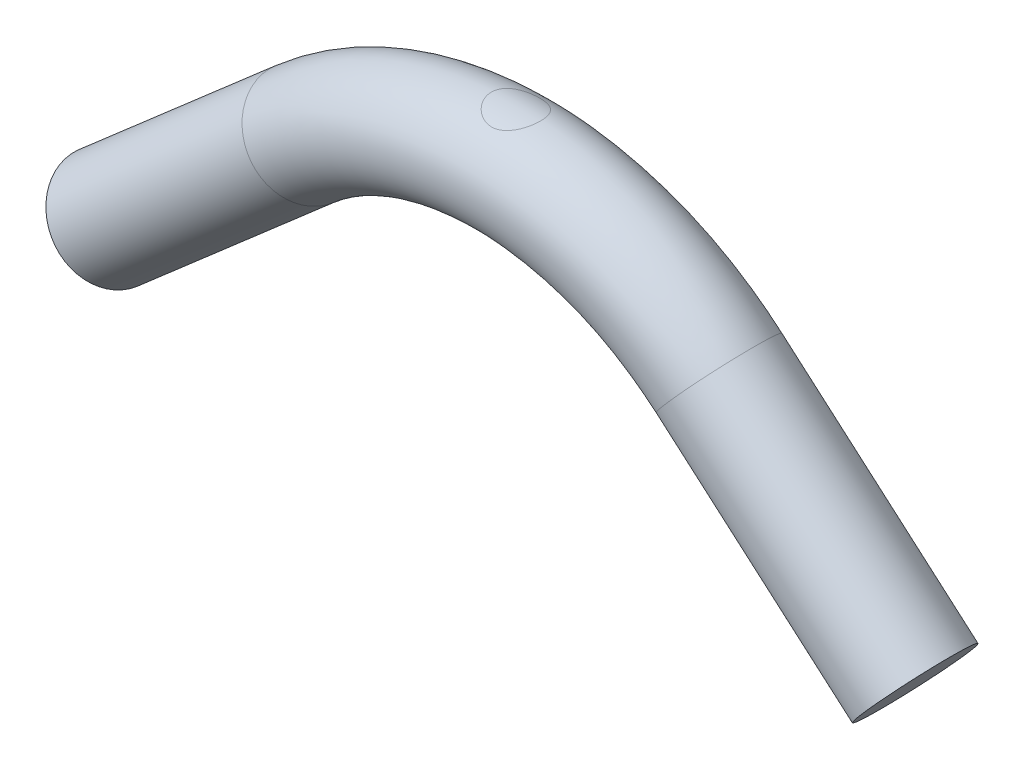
ISO-10303-21;
HEADER;
FILE_DESCRIPTION(('STEP AP214'),'2;1');
FILE_NAME('part.step','',(''),(''),'','','');
FILE_SCHEMA(('AUTOMOTIVE_DESIGN { 1 0 10303 214 1 1 1 1 }'));
ENDSEC;
DATA;
#1=APPLICATION_CONTEXT('core data for automotive mechanical design processes');
#2=APPLICATION_PROTOCOL_DEFINITION('international standard','automotive_design',2000,#1);
#3=PRODUCT_CONTEXT('',#1,'mechanical');
#4=PRODUCT('Part','Part','',(#3));
#5=PRODUCT_RELATED_PRODUCT_CATEGORY('part','',(#4));
#6=PRODUCT_DEFINITION_FORMATION('','',#4);
#7=PRODUCT_DEFINITION_CONTEXT('part definition',#1,'design');
#8=PRODUCT_DEFINITION('design','',#6,#7);
#9=PRODUCT_DEFINITION_SHAPE('','',#8);
#10=(LENGTH_UNIT() NAMED_UNIT(*) SI_UNIT(.MILLI.,.METRE.));
#11=(NAMED_UNIT(*) PLANE_ANGLE_UNIT() SI_UNIT($,.RADIAN.));
#12=(NAMED_UNIT(*) SI_UNIT($,.STERADIAN.) SOLID_ANGLE_UNIT());
#13=UNCERTAINTY_MEASURE_WITH_UNIT(LENGTH_MEASURE(1.E-05),#10,'distance_accuracy_value','');
#14=(GEOMETRIC_REPRESENTATION_CONTEXT(3) GLOBAL_UNCERTAINTY_ASSIGNED_CONTEXT((#13)) GLOBAL_UNIT_ASSIGNED_CONTEXT((#10,
#11,#12)) REPRESENTATION_CONTEXT('',''));
#15=CARTESIAN_POINT('',(0.,0.,0.));
#16=DIRECTION('',(0.,0.,1.));
#17=DIRECTION('',(1.,0.,0.));
#18=AXIS2_PLACEMENT_3D('',#15,#16,#17);
#19=CARTESIAN_POINT('',(115.,-19.2676138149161,0.));
#20=DIRECTION('',(0.,0.,-1.));
#21=DIRECTION('',(-1.,0.,0.));
#22=AXIS2_PLACEMENT_3D('',#19,#20,#21);
#23=TOROIDAL_SURFACE('',#22,90.,15.);
#24=CARTESIAN_POINT('',(110.588080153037,85.0106860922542,-4.2962066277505));
#25=CARTESIAN_POINT('',(110.710333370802,84.9688042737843,-4.4534690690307));
#26=CARTESIAN_POINT('',(110.839197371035,84.9257780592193,-4.60537547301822));
#27=CARTESIAN_POINT('',(111.1092662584,84.8385685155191,-4.89755901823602));
#28=CARTESIAN_POINT('',(111.250478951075,84.7943844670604,-5.03782869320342));
#29=CARTESIAN_POINT('',(111.544722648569,84.7059378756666,-5.30620513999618));
#30=CARTESIAN_POINT('',(111.697783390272,84.6616754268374,-5.43427938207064));
#31=CARTESIAN_POINT('',(112.014505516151,84.5744150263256,-5.67705037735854));
#32=CARTESIAN_POINT('',(112.1781667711,84.5314170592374,-5.7917472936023));
#33=CARTESIAN_POINT('',(112.515366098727,84.4478828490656,-6.00711752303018));
#34=CARTESIAN_POINT('',(112.688915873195,84.4073496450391,-6.10777371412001));
#35=CARTESIAN_POINT('',(113.044595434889,84.3300760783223,-6.29406440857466));
#36=CARTESIAN_POINT('',(113.226720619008,84.2933337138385,-6.37970685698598));
#37=CARTESIAN_POINT('',(113.598324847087,84.2248607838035,-6.53519724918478));
#38=CARTESIAN_POINT('',(113.787797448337,84.1931259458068,-6.60505867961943));
#39=CARTESIAN_POINT('',(114.172914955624,84.1357511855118,-6.72834766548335));
#40=CARTESIAN_POINT('',(114.36855940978,84.1101108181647,-6.78177642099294));
#41=CARTESIAN_POINT('',(114.755652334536,84.0668680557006,-6.8695575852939));
#42=CARTESIAN_POINT('',(114.946897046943,84.0489574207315,-6.90465638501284));
#43=CARTESIAN_POINT('',(115.332170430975,84.020196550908,-6.95885151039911));
#44=CARTESIAN_POINT('',(115.526199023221,84.0093461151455,-6.97794829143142));
#45=CARTESIAN_POINT('',(115.915391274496,83.9950818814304,-6.99987763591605));
#46=CARTESIAN_POINT('',(116.110554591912,83.9916659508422,-7.00271486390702));
#47=CARTESIAN_POINT('',(116.500417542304,83.9923464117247,-6.99207973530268));
#48=CARTESIAN_POINT('',(116.695117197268,83.9964424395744,-6.97860816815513));
#49=CARTESIAN_POINT('',(117.067728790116,84.0113360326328,-6.93714730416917));
#50=CARTESIAN_POINT('',(117.245794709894,84.0216021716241,-6.91033566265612));
#51=CARTESIAN_POINT('',(117.598975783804,84.0479765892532,-6.84317181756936));
#52=CARTESIAN_POINT('',(117.774089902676,84.0640868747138,-6.80281496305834));
#53=CARTESIAN_POINT('',(118.120129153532,84.1015870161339,-6.70895336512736));
#54=CARTESIAN_POINT('',(118.291055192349,84.1229757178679,-6.65545149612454));
#55=CARTESIAN_POINT('',(118.627805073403,84.1703534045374,-6.53573510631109));
#56=CARTESIAN_POINT('',(118.793626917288,84.1963441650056,-6.46951567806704));
#57=CARTESIAN_POINT('',(119.123873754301,84.2529417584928,-6.3228119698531));
#58=CARTESIAN_POINT('',(119.28812184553,84.2836597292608,-6.24197261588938));
#59=CARTESIAN_POINT('',(119.609366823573,84.3482341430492,-6.06795742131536));
#60=CARTESIAN_POINT('',(119.766361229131,84.3820916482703,-5.97477740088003));
#61=CARTESIAN_POINT('',(120.072280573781,84.4520067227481,-5.7766867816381));
#62=CARTESIAN_POINT('',(120.221204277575,84.4880646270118,-5.67177439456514));
#63=CARTESIAN_POINT('',(120.510238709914,84.5614402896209,-5.4508349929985));
#64=CARTESIAN_POINT('',(120.65034900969,84.5987581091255,-5.33480743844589));
#65=CARTESIAN_POINT('',(120.9322498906,84.6768284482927,-5.08223563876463));
#66=CARTESIAN_POINT('',(121.073224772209,84.7176102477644,-4.94478843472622));
#67=CARTESIAN_POINT('',(121.343156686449,84.798425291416,-4.65844140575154));
#68=CARTESIAN_POINT('',(121.472117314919,84.8384587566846,-4.50954503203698));
#69=CARTESIAN_POINT('',(121.71730888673,84.9167306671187,-4.20103378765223));
#70=CARTESIAN_POINT('',(121.833533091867,84.9549681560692,-4.04141331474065));
#71=CARTESIAN_POINT('',(122.052303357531,85.0285885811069,-3.71252862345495));
#72=CARTESIAN_POINT('',(122.154855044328,85.0639726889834,-3.54326841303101));
#73=CARTESIAN_POINT('',(122.346717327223,85.1313755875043,-3.19392038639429));
#74=CARTESIAN_POINT('',(122.435847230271,85.1633470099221,-3.01372402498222));
#75=CARTESIAN_POINT('',(122.598482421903,85.2225141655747,-2.64573895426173));
#76=CARTESIAN_POINT('',(122.671994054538,85.2497118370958,-2.45795336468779));
#77=CARTESIAN_POINT('',(122.802698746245,85.2985764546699,-2.07611951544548));
#78=CARTESIAN_POINT('',(122.859894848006,85.320244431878,-1.88207243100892));
#79=CARTESIAN_POINT('',(122.957367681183,85.3574319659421,-1.48919977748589));
#80=CARTESIAN_POINT('',(122.997645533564,85.3729519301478,-1.29037452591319));
#81=CARTESIAN_POINT('',(123.058913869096,85.3966527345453,-0.901706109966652));
#82=CARTESIAN_POINT('',(123.080923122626,85.4052205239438,-0.712046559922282));
#83=CARTESIAN_POINT('',(123.109372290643,85.4163072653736,-0.331389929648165));
#84=CARTESIAN_POINT('',(123.115812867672,85.4188264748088,-0.140392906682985));
#85=CARTESIAN_POINT('',(123.113056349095,85.4177499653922,0.241433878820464));
#86=CARTESIAN_POINT('',(123.10386215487,85.4141553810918,0.432263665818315));
#87=CARTESIAN_POINT('',(123.069940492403,85.4009480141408,0.81232491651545));
#88=CARTESIAN_POINT('',(123.045213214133,85.391335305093,1.00155639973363));
#89=CARTESIAN_POINT('',(122.981706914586,85.3668148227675,1.36992080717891));
#90=CARTESIAN_POINT('',(122.943492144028,85.3521200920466,1.54916566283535));
#91=CARTESIAN_POINT('',(122.853261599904,85.3177364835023,1.90371771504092));
#92=CARTESIAN_POINT('',(122.801241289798,85.2980459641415,2.07902359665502));
#93=CARTESIAN_POINT('',(122.683878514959,85.2541417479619,2.42447362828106));
#94=CARTESIAN_POINT('',(122.618539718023,85.2299292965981,2.59461918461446));
#95=CARTESIAN_POINT('',(122.475036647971,85.1775264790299,2.92884814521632));
#96=CARTESIAN_POINT('',(122.396867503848,85.1493346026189,3.09292921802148));
#97=CARTESIAN_POINT('',(122.225485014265,85.0886207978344,3.41941645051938));
#98=CARTESIAN_POINT('',(122.131856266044,85.0559856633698,3.58158346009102));
#99=CARTESIAN_POINT('',(121.932185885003,84.9879273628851,3.89754163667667));
#100=CARTESIAN_POINT('',(121.826139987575,84.9525032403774,4.05132989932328));
#101=CARTESIAN_POINT('',(121.602331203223,84.8797145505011,4.34968686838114));
#102=CARTESIAN_POINT('',(121.484566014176,84.8423496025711,4.49425375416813));
#103=CARTESIAN_POINT('',(121.238034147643,84.7665831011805,4.77339229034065));
#104=CARTESIAN_POINT('',(121.109267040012,84.7281815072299,4.90796354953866));
#105=CARTESIAN_POINT('',(120.83296549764,84.6488510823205,5.17458545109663));
#106=CARTESIAN_POINT('',(120.68475926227,84.6079159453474,5.30593902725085));
#107=CARTESIAN_POINT('',(120.377627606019,84.5271266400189,5.55570944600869));
#108=CARTESIAN_POINT('',(120.218705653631,84.4872721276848,5.67413044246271));
#109=CARTESIAN_POINT('',(119.89091851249,84.4098115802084,5.89736247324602));
#110=CARTESIAN_POINT('',(119.722048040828,84.3722067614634,6.00216618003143));
#111=CARTESIAN_POINT('',(119.375507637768,84.3004965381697,6.19726639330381));
#112=CARTESIAN_POINT('',(119.197841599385,84.2663896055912,6.28756924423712));
#113=CARTESIAN_POINT('',(118.834269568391,84.2027551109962,6.45317700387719));
#114=CARTESIAN_POINT('',(118.648343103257,84.1732398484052,6.5284417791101));
#115=CARTESIAN_POINT('',(118.270045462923,84.1200229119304,6.6629125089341));
#116=CARTESIAN_POINT('',(118.077677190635,84.0963186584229,6.72212559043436));
#117=CARTESIAN_POINT('',(117.687969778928,84.0556852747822,6.82386208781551));
#118=CARTESIAN_POINT('',(117.490633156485,84.0387527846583,6.86639378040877));
#119=CARTESIAN_POINT('',(117.092538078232,84.01239764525,6.93429383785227));
#120=CARTESIAN_POINT('',(116.891779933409,84.0029743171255,6.95966375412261));
#121=CARTESIAN_POINT('',(116.504768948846,83.9925301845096,6.99159556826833));
#122=CARTESIAN_POINT('',(116.318642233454,83.990896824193,6.99950115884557));
#123=CARTESIAN_POINT('',(115.94641886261,83.9944771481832,7.00045299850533));
#124=CARTESIAN_POINT('',(115.760322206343,83.9996905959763,6.99349976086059));
#125=CARTESIAN_POINT('',(115.389592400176,84.0168226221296,6.96483359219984));
#126=CARTESIAN_POINT('',(115.204959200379,84.0287409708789,6.94312116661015));
#127=CARTESIAN_POINT('',(114.838509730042,84.0589036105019,6.88519875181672));
#128=CARTESIAN_POINT('',(114.656693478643,84.0771479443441,6.84898866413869));
#129=CARTESIAN_POINT('',(114.3028996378,84.1187028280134,6.76385396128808));
#130=CARTESIAN_POINT('',(114.130793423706,84.1418324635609,6.7153735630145));
#131=CARTESIAN_POINT('',(113.791370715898,84.1928110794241,6.60563055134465));
#132=CARTESIAN_POINT('',(113.624055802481,84.2206615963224,6.54436377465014));
#133=CARTESIAN_POINT('',(113.295192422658,84.2803103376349,6.40955658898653));
#134=CARTESIAN_POINT('',(113.133643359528,84.3121081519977,6.3360174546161));
#135=CARTESIAN_POINT('',(112.817077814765,84.3788300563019,6.17718672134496));
#136=CARTESIAN_POINT('',(112.66206372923,84.4137552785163,6.09189085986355));
#137=CARTESIAN_POINT('',(112.185889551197,84.527199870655,5.80590071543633));
#138=CARTESIAN_POINT('',(111.877636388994,84.6098627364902,5.58486502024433));
#139=CARTESIAN_POINT('',(111.300992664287,84.7771921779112,5.09626568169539));
#140=CARTESIAN_POINT('',(111.032618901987,84.8618595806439,4.82868253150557));
#141=CARTESIAN_POINT('',(110.656758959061,84.9868457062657,4.38774965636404));
#142=CARTESIAN_POINT('',(110.532732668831,85.0293850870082,4.22886253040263));
#143=CARTESIAN_POINT('',(110.298553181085,85.1116147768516,3.90051516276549));
#144=CARTESIAN_POINT('',(110.188394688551,85.1513061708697,3.73105899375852));
#145=CARTESIAN_POINT('',(109.982792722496,85.2267917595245,3.38255586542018));
#146=CARTESIAN_POINT('',(109.887353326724,85.2625848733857,3.20350626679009));
#147=CARTESIAN_POINT('',(109.712122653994,85.3292764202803,2.83712420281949));
#148=CARTESIAN_POINT('',(109.632323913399,85.3601771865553,2.64979574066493));
#149=CARTESIAN_POINT('',(109.491432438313,85.4153422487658,2.27427805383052));
#150=CARTESIAN_POINT('',(109.429820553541,85.4397880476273,2.08631035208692));
#151=CARTESIAN_POINT('',(109.322620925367,85.4826476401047,1.70526817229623));
#152=CARTESIAN_POINT('',(109.277026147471,85.5010640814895,1.51219597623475));
#153=CARTESIAN_POINT('',(109.202346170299,85.531371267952,1.12244027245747));
#154=CARTESIAN_POINT('',(109.173255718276,85.5432640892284,0.925757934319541));
#155=CARTESIAN_POINT('',(109.131906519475,85.5602014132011,0.53034304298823));
#156=CARTESIAN_POINT('',(109.119646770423,85.5652463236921,0.331610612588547));
#157=CARTESIAN_POINT('',(109.112361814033,85.5682422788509,-0.0525573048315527));
#158=CARTESIAN_POINT('',(109.116211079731,85.5666566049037,-0.237968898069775));
#159=CARTESIAN_POINT('',(109.138590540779,85.5574650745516,-0.607752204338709));
#160=CARTESIAN_POINT('',(109.157120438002,85.5498593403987,-0.792123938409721));
#161=CARTESIAN_POINT('',(109.208680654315,85.5288071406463,-1.15857657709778));
#162=CARTESIAN_POINT('',(109.241717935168,85.5153578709,-1.3406563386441));
#163=CARTESIAN_POINT('',(109.321961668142,85.4829410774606,-1.70115684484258));
#164=CARTESIAN_POINT('',(109.369167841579,85.4639736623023,-1.87957766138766));
#165=CARTESIAN_POINT('',(109.476837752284,85.4211512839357,-2.23007003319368));
#166=CARTESIAN_POINT('',(109.537184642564,85.397339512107,-2.40218284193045));
#167=CARTESIAN_POINT('',(109.670873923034,85.345256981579,-2.74067575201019));
#168=CARTESIAN_POINT('',(109.744222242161,85.3169841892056,-2.9070531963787));
#169=CARTESIAN_POINT('',(109.903134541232,85.2566806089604,-3.23268376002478));
#170=CARTESIAN_POINT('',(109.988671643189,85.2246581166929,-3.3919515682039));
#171=CARTESIAN_POINT('',(110.171469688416,85.157496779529,-3.70290615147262));
#172=CARTESIAN_POINT('',(110.268728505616,85.1223585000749,-3.85459429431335));
#173=CARTESIAN_POINT('',(110.406347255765,85.0737364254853,-4.05208266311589));
#174=CARTESIAN_POINT('',(110.441822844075,85.0612916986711,-4.10159895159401));
#175=CARTESIAN_POINT('',(110.514020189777,85.0361622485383,-4.1996455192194));
#176=CARTESIAN_POINT('',(110.550741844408,85.0234775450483,-4.248175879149));
#177=CARTESIAN_POINT('',(110.588080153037,85.0106860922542,-4.2962066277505));
#178=B_SPLINE_CURVE_WITH_KNOTS('',3,(#24,#25,#26,#27,#28,#29,#30,#31,#32,#33,#34,#35,#36,#37,
#38,#39,#40,#41,#42,#43,#44,#45,#46,#47,#48,#49,#50,#51,#52,#53,#54,#55,#56,#57,#58,#59,#60,#61,
#62,#63,#64,#65,#66,#67,#68,#69,#70,#71,#72,#73,#74,#75,#76,#77,#78,#79,#80,#81,#82,#83,#84,#85,
#86,#87,#88,#89,#90,#91,#92,#93,#94,#95,#96,#97,#98,#99,#100,#101,#102,#103,#104,#105,#106,#107,
#108,#109,#110,#111,#112,#113,#114,#115,#116,#117,#118,#119,#120,#121,#122,#123,#124,#125,#126,
#127,#128,#129,#130,#131,#132,#133,#134,#135,#136,#137,#138,#139,#140,#141,#142,#143,#144,#145,
#146,#147,#148,#149,#150,#151,#152,#153,#154,#155,#156,#157,#158,#159,#160,#161,#162,#163,#164,
#165,#166,#167,#168,#169,#170,#171,#172,#173,#174,#175,#176,#177),.UNSPECIFIED.,.T.,.F.,(4,2,2,
2,2,2,2,2,2,2,2,2,2,2,2,2,2,2,2,2,2,2,2,2,2,2,2,2,2,2,2,2,2,2,2,2,2,2,2,2,2,2,2,2,2,2,2,2,2,2,2,
2,2,2,2,2,2,2,2,2,2,2,2,2,2,2,2,2,2,2,2,2,2,2,2,2,4),(0.,0.610583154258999,1.22155508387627,
1.83411354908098,2.44666454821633,3.05995611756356,3.67292215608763,4.28536234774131,
4.89775780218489,5.4827606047,6.06774675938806,6.65256508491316,7.23735510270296,
7.77782479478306,8.31848025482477,8.85901759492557,9.39976393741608,9.9560409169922,
10.5125067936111,11.0690576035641,11.6256354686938,12.2281490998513,12.8304818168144,
13.433131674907,14.0355327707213,14.6454316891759,15.2550823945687,15.8646193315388,
16.4741158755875,17.0467669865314,17.6193937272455,18.1919142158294,18.7644277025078,
19.3153806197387,19.8665148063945,20.4174974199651,20.9686896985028,21.5382990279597,
22.1081045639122,22.678022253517,23.2479622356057,23.8539298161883,24.4597021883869,
25.0657991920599,25.6716302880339,26.2790572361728,26.8862140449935,27.49306922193,
28.0998695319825,28.6580674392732,29.216246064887,29.7744055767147,30.3325688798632,
30.8728608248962,31.4133289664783,31.9537410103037,32.4943495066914,33.6537163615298,
34.8135702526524,35.4309340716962,36.0480614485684,36.6653594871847,37.2823622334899,
37.879517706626,38.4764105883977,39.0731133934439,39.6697806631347,40.2254808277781,
40.7811697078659,41.3371255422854,41.8930704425,42.4442602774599,42.9957021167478,
43.5459462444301,44.0960907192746,44.2825890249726,44.4690719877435),.UNSPECIFIED.);
#179=CARTESIAN_POINT('',(110.588080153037,85.0106860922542,-4.2962066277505));
#180=VERTEX_POINT('',#179);
#181=EDGE_CURVE('E43',#180,#180,#178,.T.);
#182=ORIENTED_EDGE('',*,*,#181,.T.);
#183=EDGE_LOOP('',(#182));
#184=FACE_BOUND('',#183,.T.);
#185=CARTESIAN_POINT('',(55.9439156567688,48.6468831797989,0.));
#186=DIRECTION('',(0.7546055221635,0.656178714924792,0.));
#187=DIRECTION('',(0.,0.,-1.));
#188=AXIS2_PLACEMENT_3D('',#185,#186,#187);
#189=CIRCLE('',#188,15.);
#190=CARTESIAN_POINT('',(65.7865963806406,37.3278003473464,0.));
#191=VERTEX_POINT('',#190);
#192=EDGE_CURVE('E100',#191,#191,#189,.T.);
#193=ORIENTED_EDGE('',*,*,#192,.T.);
#194=EDGE_LOOP('',(#193));
#195=FACE_BOUND('',#194,.T.);
#196=CARTESIAN_POINT('',(174.056084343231,48.6468831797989,0.));
#197=DIRECTION('',(0.754605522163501,-0.656178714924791,0.));
#198=DIRECTION('',(0.,0.,-1.));
#199=AXIS2_PLACEMENT_3D('',#196,#197,#198);
#200=CIRCLE('',#199,15.);
#201=CARTESIAN_POINT('',(174.056084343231,48.6468831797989,-15.));
#202=VERTEX_POINT('',#201);
#203=EDGE_CURVE('E105',#202,#202,#200,.T.);
#204=ORIENTED_EDGE('',*,*,#203,.F.);
#205=EDGE_LOOP('',(#204));
#206=FACE_BOUND('',#205,.T.);
#207=CARTESIAN_POINT('',(109.933391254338,55.9260523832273,-3.28518633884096));
#208=CARTESIAN_POINT('',(109.850554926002,55.885405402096,-3.12933368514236));
#209=CARTESIAN_POINT('',(109.773418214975,55.8468356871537,-2.96996870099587));
#210=CARTESIAN_POINT('',(109.631107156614,55.7747094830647,-2.64490910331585));
#211=CARTESIAN_POINT('',(109.565928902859,55.7411513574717,-2.47921657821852));
#212=CARTESIAN_POINT('',(109.448105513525,55.6798497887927,-2.14230960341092));
#213=CARTESIAN_POINT('',(109.395465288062,55.6521086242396,-1.97109302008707));
#214=CARTESIAN_POINT('',(109.30331881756,55.6031764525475,-1.62431099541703));
#215=CARTESIAN_POINT('',(109.26380711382,55.5819827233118,-1.44874739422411));
#216=CARTESIAN_POINT('',(109.19823362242,55.5466375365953,-1.09376995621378));
#217=CARTESIAN_POINT('',(109.172219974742,55.5325112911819,-0.914344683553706));
#218=CARTESIAN_POINT('',(109.134183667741,55.5118103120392,-0.553578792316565));
#219=CARTESIAN_POINT('',(109.122161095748,55.5052356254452,-0.372238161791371));
#220=CARTESIAN_POINT('',(109.112266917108,55.4998269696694,-0.0090883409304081));
#221=CARTESIAN_POINT('',(109.114392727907,55.5009915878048,0.172720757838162));
#222=CARTESIAN_POINT('',(109.132761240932,55.5110249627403,0.535405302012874));
#223=CARTESIAN_POINT('',(109.149003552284,55.5198935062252,0.716280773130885));
#224=CARTESIAN_POINT('',(109.194351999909,55.5445161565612,1.06766132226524));
#225=CARTESIAN_POINT('',(109.222850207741,55.5599445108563,1.23826836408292));
#226=CARTESIAN_POINT('',(109.292221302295,55.5972131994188,1.57629228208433));
#227=CARTESIAN_POINT('',(109.333098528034,55.6190557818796,1.74370801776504));
#228=CARTESIAN_POINT('',(109.42678661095,55.6686122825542,2.07422933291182));
#229=CARTESIAN_POINT('',(109.479595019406,55.6963249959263,2.23733578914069));
#230=CARTESIAN_POINT('',(109.596671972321,55.7569884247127,2.55843976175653));
#231=CARTESIAN_POINT('',(109.660945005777,55.7899411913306,2.71643524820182));
#232=CARTESIAN_POINT('',(109.803620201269,55.8619713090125,3.03363393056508));
#233=CARTESIAN_POINT('',(109.882536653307,55.9012607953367,3.19255779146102));
#234=CARTESIAN_POINT('',(110.051700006,55.9838618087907,3.50319043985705));
#235=CARTESIAN_POINT('',(110.141950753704,56.0271747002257,3.65489675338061));
#236=CARTESIAN_POINT('',(110.428795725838,56.1617269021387,4.09820480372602));
#237=CARTESIAN_POINT('',(110.64154113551,56.2576102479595,4.37812457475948));
#238=CARTESIAN_POINT('',(111.132614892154,56.4651011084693,4.93278331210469));
#239=CARTESIAN_POINT('',(111.415692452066,56.5772406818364,5.20313606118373));
#240=CARTESIAN_POINT('',(111.871962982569,56.7405613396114,5.5711918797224));
#241=CARTESIAN_POINT('',(112.029453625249,56.794223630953,5.68770192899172));
#242=CARTESIAN_POINT('',(112.354438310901,56.8984238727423,5.90758204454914));
#243=CARTESIAN_POINT('',(112.521933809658,56.9489613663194,6.01095019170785));
#244=CARTESIAN_POINT('',(112.872765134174,57.0472016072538,6.20744543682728));
#245=CARTESIAN_POINT('',(113.056463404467,57.094718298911,6.30001960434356));
#246=CARTESIAN_POINT('',(113.432595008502,57.1829107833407,6.46909885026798));
#247=CARTESIAN_POINT('',(113.625023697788,57.2235901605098,6.54561235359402));
#248=CARTESIAN_POINT('',(114.017158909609,57.2964360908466,6.68159298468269));
#249=CARTESIAN_POINT('',(114.216857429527,57.3286117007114,6.74107825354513));
#250=CARTESIAN_POINT('',(114.622039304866,57.3830352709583,6.84220611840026));
#251=CARTESIAN_POINT('',(114.827521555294,57.4052851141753,6.88385209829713));
#252=CARTESIAN_POINT('',(115.217354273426,57.4367328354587,6.94471296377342));
#253=CARTESIAN_POINT('',(115.401279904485,57.4471770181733,6.96602063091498));
#254=CARTESIAN_POINT('',(115.770527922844,57.4590600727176,6.99398833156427));
#255=CARTESIAN_POINT('',(115.955850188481,57.460499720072,7.00064962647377));
#256=CARTESIAN_POINT('',(116.326238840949,57.4542531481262,6.99925059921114));
#257=CARTESIAN_POINT('',(116.51130527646,57.4465690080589,6.99119363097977));
#258=CARTESIAN_POINT('',(116.87963072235,57.4223125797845,6.96052483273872));
#259=CARTESIAN_POINT('',(117.062889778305,57.4057405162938,6.93791337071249));
#260=CARTESIAN_POINT('',(117.40965439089,57.3661480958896,6.88119790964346));
#261=CARTESIAN_POINT('',(117.573445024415,57.3438482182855,6.84832112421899));
#262=CARTESIAN_POINT('',(117.897363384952,57.2929767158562,6.77123078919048));
#263=CARTESIAN_POINT('',(118.057489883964,57.2644030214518,6.72701349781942));
#264=CARTESIAN_POINT('',(118.530994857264,57.1703626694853,6.5780281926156));
#265=CARTESIAN_POINT('',(118.837722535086,57.09654962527,6.45688942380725));
#266=CARTESIAN_POINT('',(119.453484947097,56.9264219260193,6.16267158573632));
#267=CARTESIAN_POINT('',(119.760383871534,56.8287055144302,5.98598162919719));
#268=CARTESIAN_POINT('',(120.342251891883,56.6241435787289,5.59026743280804));
#269=CARTESIAN_POINT('',(120.617198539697,56.5172917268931,5.37121371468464));
#270=CARTESIAN_POINT('',(121.167239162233,56.2882922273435,4.86110788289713));
#271=CARTESIAN_POINT('',(121.43702584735,56.1660858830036,4.56427808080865));
#272=CARTESIAN_POINT('',(121.801980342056,55.9919702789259,4.08586020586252));
#273=CARTESIAN_POINT('',(121.917064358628,55.9354349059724,3.92075668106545));
#274=CARTESIAN_POINT('',(122.13321618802,55.8268803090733,3.58010025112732));
#275=CARTESIAN_POINT('',(122.234282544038,55.7748615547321,3.40454626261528));
#276=CARTESIAN_POINT('',(122.421895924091,55.6765783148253,3.04301517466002));
#277=CARTESIAN_POINT('',(122.508361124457,55.6303466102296,2.85698665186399));
#278=CARTESIAN_POINT('',(122.665069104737,55.5454021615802,2.47665936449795));
#279=CARTESIAN_POINT('',(122.735320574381,55.5066853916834,2.28236509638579));
#280=CARTESIAN_POINT('',(122.858640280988,55.4380433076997,1.88705594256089));
#281=CARTESIAN_POINT('',(122.911722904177,55.4081106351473,1.68604684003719));
#282=CARTESIAN_POINT('',(122.999939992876,55.3580485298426,1.27893799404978));
#283=CARTESIAN_POINT('',(123.035077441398,55.337917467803,1.07283910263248));
#284=CARTESIAN_POINT('',(123.083559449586,55.3100574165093,0.6836250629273));
#285=CARTESIAN_POINT('',(123.099083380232,55.3010902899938,0.500866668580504));
#286=CARTESIAN_POINT('',(123.115726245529,55.2914748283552,0.134483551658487));
#287=CARTESIAN_POINT('',(123.116846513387,55.2908257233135,-0.0491410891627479));
#288=CARTESIAN_POINT('',(123.104667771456,55.2978648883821,-0.415711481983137));
#289=CARTESIAN_POINT('',(123.091371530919,55.3055515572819,-0.598657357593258));
#290=CARTESIAN_POINT('',(123.050555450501,55.329033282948,-0.962422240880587));
#291=CARTESIAN_POINT('',(123.02303577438,55.3448282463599,-1.1432412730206));
#292=CARTESIAN_POINT('',(122.956437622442,55.3827706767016,-1.48944929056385));
#293=CARTESIAN_POINT('',(122.918249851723,55.4044256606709,-1.65506455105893));
#294=CARTESIAN_POINT('',(122.830226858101,55.4538864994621,-1.98225207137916));
#295=CARTESIAN_POINT('',(122.780387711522,55.4816944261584,-2.14382294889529));
#296=CARTESIAN_POINT('',(122.614127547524,55.5734192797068,-2.62099858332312));
#297=CARTESIAN_POINT('',(122.480912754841,55.6456673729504,-2.92932741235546));
#298=CARTESIAN_POINT('',(122.16266660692,55.8123722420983,-3.54250955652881));
#299=CARTESIAN_POINT('',(121.974502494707,55.90808679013,-3.84537433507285));
#300=CARTESIAN_POINT('',(121.556607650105,56.1100774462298,-4.41704614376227));
#301=CARTESIAN_POINT('',(121.326848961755,56.2163606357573,-4.68583006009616));
#302=CARTESIAN_POINT('',(120.798507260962,56.4445796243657,-5.21713390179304));
#303=CARTESIAN_POINT('',(120.494899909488,56.5668001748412,-5.47459651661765));
#304=CARTESIAN_POINT('',(120.008454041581,56.7424748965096,-5.82045871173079));
#305=CARTESIAN_POINT('',(119.841013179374,56.7997921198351,-5.92908201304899));
#306=CARTESIAN_POINT('',(119.496356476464,56.9102842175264,-6.13219508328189));
#307=CARTESIAN_POINT('',(119.319139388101,56.9634585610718,-6.22668304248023));
#308=CARTESIAN_POINT('',(118.952475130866,57.064925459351,-6.40223813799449));
#309=CARTESIAN_POINT('',(118.762861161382,57.1131080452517,-6.48302105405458));
#310=CARTESIAN_POINT('',(118.375727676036,57.2016966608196,-6.62797561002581));
#311=CARTESIAN_POINT('',(118.178212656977,57.242107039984,-6.69215654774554));
#312=CARTESIAN_POINT('',(117.77690577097,57.3135602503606,-6.80294567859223));
#313=CARTESIAN_POINT('',(117.573121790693,57.3446143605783,-6.84957504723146));
#314=CARTESIAN_POINT('',(117.160904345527,57.3961027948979,-6.9245316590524));
#315=CARTESIAN_POINT('',(116.952471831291,57.4165392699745,-6.95286260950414));
#316=CARTESIAN_POINT('',(116.561845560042,57.4438989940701,-6.98806225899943));
#317=CARTESIAN_POINT('',(116.379967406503,57.4522895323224,-6.99733876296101));
#318=CARTESIAN_POINT('',(116.01585647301,57.4602593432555,-7.00167005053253));
#319=CARTESIAN_POINT('',(115.833623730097,57.4598394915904,-6.99672624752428));
#320=CARTESIAN_POINT('',(115.470348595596,57.4502660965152,-6.97266497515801));
#321=CARTESIAN_POINT('',(115.289306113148,57.4411132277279,-6.95354860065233));
#322=CARTESIAN_POINT('',(114.929866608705,57.4144750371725,-6.90140193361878));
#323=CARTESIAN_POINT('',(114.751469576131,57.3969897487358,-6.86837169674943));
#324=CARTESIAN_POINT('',(114.411640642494,57.3559320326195,-6.79175506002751));
#325=CARTESIAN_POINT('',(114.249926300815,57.332902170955,-6.74912422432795));
#326=CARTESIAN_POINT('',(113.93079648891,57.2809746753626,-6.65272483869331));
#327=CARTESIAN_POINT('',(113.77338247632,57.2520750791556,-6.59895256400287));
#328=CARTESIAN_POINT('',(113.308815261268,57.1577552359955,-6.4216209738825));
#329=CARTESIAN_POINT('',(113.009179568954,57.084693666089,-6.28201092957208));
#330=CARTESIAN_POINT('',(112.405896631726,56.9171793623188,-5.94780617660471));
#331=CARTESIAN_POINT('',(112.104980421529,56.821302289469,-5.74904499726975));
#332=CARTESIAN_POINT('',(111.538416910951,56.6230240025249,-5.30913801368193));
#333=CARTESIAN_POINT('',(111.272766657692,56.520623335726,-5.06799576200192));
#334=CARTESIAN_POINT('',(110.81267729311,56.3314986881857,-4.58113048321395));
#335=CARTESIAN_POINT('',(110.613472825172,56.2444556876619,-4.34000639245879));
#336=CARTESIAN_POINT('',(110.247901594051,56.0780784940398,-3.83139325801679));
#337=CARTESIAN_POINT('',(110.08153211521,55.9987436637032,-3.56390639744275));
#338=CARTESIAN_POINT('',(109.933391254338,55.9260523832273,-3.28518633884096));
#339=B_SPLINE_CURVE_WITH_KNOTS('',3,(#207,#208,#209,#210,#211,#212,#213,#214,#215,#216,#217,
#218,#219,#220,#221,#222,#223,#224,#225,#226,#227,#228,#229,#230,#231,#232,#233,#234,#235,#236,
#237,#238,#239,#240,#241,#242,#243,#244,#245,#246,#247,#248,#249,#250,#251,#252,#253,#254,#255,
#256,#257,#258,#259,#260,#261,#262,#263,#264,#265,#266,#267,#268,#269,#270,#271,#272,#273,#274,
#275,#276,#277,#278,#279,#280,#281,#282,#283,#284,#285,#286,#287,#288,#289,#290,#291,#292,#293,
#294,#295,#296,#297,#298,#299,#300,#301,#302,#303,#304,#305,#306,#307,#308,#309,#310,#311,#312,
#313,#314,#315,#316,#317,#318,#319,#320,#321,#322,#323,#324,#325,#326,#327,#328,#329,#330,#331,
#332,#333,#334,#335,#336,#337,#338),.UNSPECIFIED.,.T.,.F.,(4,2,2,2,2,2,2,2,2,2,2,2,2,2,2,2,2,2,
2,2,2,2,2,2,2,2,2,2,2,2,2,2,2,2,2,2,2,2,2,2,2,2,2,2,2,2,2,2,2,2,2,2,2,2,2,2,2,2,2,2,2,2,2,2,2,
4),(0.,0.543124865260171,1.08607199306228,1.62923140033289,2.17216468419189,2.7170212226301,
3.26188116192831,3.80664164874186,4.35138705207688,4.87176476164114,5.39232508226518,
5.91277866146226,6.43343647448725,6.97806685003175,7.52288258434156,8.61208418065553,
9.82792244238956,10.4367184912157,11.045603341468,11.6781116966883,12.3102874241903,
12.9417871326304,13.5731669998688,14.1287430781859,14.6842713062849,15.2396729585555,
15.7950605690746,16.3001162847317,16.8053388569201,17.8151062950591,18.913017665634,
20.0116957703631,21.2633135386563,21.8898263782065,22.5164042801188,23.1463846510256,
23.7760265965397,24.4051395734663,25.0341479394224,25.5843230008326,26.1344471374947,
26.6844656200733,27.2344777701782,27.7479016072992,28.2614985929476,29.2878984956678,
30.3911445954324,31.4951349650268,32.7382405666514,33.3606085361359,33.9830561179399,
34.6171511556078,35.2508903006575,35.8838623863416,36.5167061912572,37.0628864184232,
37.6090123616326,38.1550961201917,38.7011776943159,39.2070780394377,39.7131477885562,
40.7248046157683,41.8400535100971,42.9552089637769,43.9265900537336,44.8978907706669),.UNSPECIFIED.);
#340=CARTESIAN_POINT('',(109.933391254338,55.9260523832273,-3.28518633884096));
#341=VERTEX_POINT('',#340);
#342=EDGE_CURVE('E10',#341,#341,#339,.T.);
#343=ORIENTED_EDGE('',*,*,#342,.T.);
#344=EDGE_LOOP('',(#343));
#345=FACE_BOUND('',#344,.T.);
#346=ADVANCED_FACE('F39',(#184,#195,#206,#345),#23,.T.);
#347=ORIENTED_EDGE('',*,*,#342,.F.);
#348=EDGE_LOOP('',(#347));
#349=FACE_BOUND('',#348,.T.);
#350=ADVANCED_FACE('F66',(#349),#23,.T.);
#351=CARTESIAN_POINT('',(55.9439156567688,48.6468831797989,0.));
#352=DIRECTION('',(-0.754605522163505,-0.656178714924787,0.));
#353=DIRECTION('',(0.656178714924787,-0.754605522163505,0.));
#354=AXIS2_PLACEMENT_3D('',#351,#352,#353);
#355=CYLINDRICAL_SURFACE('',#354,15.);
#356=CARTESIAN_POINT('',(0.,0.,0.));
#357=DIRECTION('',(0.7546055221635,0.656178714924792,0.));
#358=DIRECTION('',(0.,0.,-1.));
#359=AXIS2_PLACEMENT_3D('',#356,#357,#358);
#360=CIRCLE('',#359,15.);
#361=CARTESIAN_POINT('',(9.84268072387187,-11.3190828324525,0.));
#362=VERTEX_POINT('',#361);
#363=EDGE_CURVE('E60',#362,#362,#360,.T.);
#364=CARTESIAN_POINT('',(65.7865963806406,37.3278003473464,0.));
#365=CARTESIAN_POINT('',(65.203847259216,36.8210619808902,0.));
#366=CARTESIAN_POINT('',(64.6210981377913,36.3143236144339,0.));
#367=CARTESIAN_POINT('',(63.455599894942,35.3008468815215,0.));
#368=CARTESIAN_POINT('',(62.8728507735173,34.7941085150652,0.));
#369=CARTESIAN_POINT('',(61.7073525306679,33.7806317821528,0.));
#370=CARTESIAN_POINT('',(61.1246034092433,33.2738934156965,0.));
#371=CARTESIAN_POINT('',(59.9591051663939,32.260416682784,0.));
#372=CARTESIAN_POINT('',(59.3763560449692,31.7536783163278,0.));
#373=CARTESIAN_POINT('',(58.2108578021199,30.7402015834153,0.));
#374=CARTESIAN_POINT('',(57.6281086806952,30.2334632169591,0.));
#375=CARTESIAN_POINT('',(56.4626104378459,29.2199864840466,0.));
#376=CARTESIAN_POINT('',(55.8798613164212,28.7132481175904,0.));
#377=CARTESIAN_POINT('',(54.7143630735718,27.6997713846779,0.));
#378=CARTESIAN_POINT('',(54.1316139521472,27.1930330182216,0.));
#379=CARTESIAN_POINT('',(52.9661157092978,26.1795562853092,0.));
#380=CARTESIAN_POINT('',(52.3833665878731,25.6728179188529,0.));
#381=CARTESIAN_POINT('',(51.2178683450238,24.6593411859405,0.));
#382=CARTESIAN_POINT('',(50.6351192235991,24.1526028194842,0.));
#383=CARTESIAN_POINT('',(49.4696209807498,23.1391260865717,0.));
#384=CARTESIAN_POINT('',(48.8868718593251,22.6323877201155,0.));
#385=CARTESIAN_POINT('',(47.7213736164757,21.618910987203,0.));
#386=CARTESIAN_POINT('',(47.1386244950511,21.1121726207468,0.));
#387=CARTESIAN_POINT('',(45.9731262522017,20.0986958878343,0.));
#388=CARTESIAN_POINT('',(45.390377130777,19.5919575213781,0.));
#389=CARTESIAN_POINT('',(44.2248788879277,18.5784807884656,0.));
#390=CARTESIAN_POINT('',(43.642129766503,18.0717424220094,0.));
#391=CARTESIAN_POINT('',(42.4766315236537,17.0582656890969,0.));
#392=CARTESIAN_POINT('',(41.893882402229,16.5515273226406,0.));
#393=CARTESIAN_POINT('',(40.7283841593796,15.5380505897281,0.));
#394=CARTESIAN_POINT('',(40.145635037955,15.0313122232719,0.));
#395=CARTESIAN_POINT('',(38.9801367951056,14.0178354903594,0.));
#396=CARTESIAN_POINT('',(38.3973876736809,13.5110971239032,0.));
#397=CARTESIAN_POINT('',(37.2318894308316,12.4976203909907,0.));
#398=CARTESIAN_POINT('',(36.6491403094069,11.9908820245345,0.));
#399=CARTESIAN_POINT('',(35.4836420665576,10.977405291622,0.));
#400=CARTESIAN_POINT('',(34.9008929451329,10.4706669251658,0.));
#401=CARTESIAN_POINT('',(33.7353947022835,9.45719019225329,0.));
#402=CARTESIAN_POINT('',(33.1526455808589,8.95045182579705,0.));
#403=CARTESIAN_POINT('',(31.9871473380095,7.93697509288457,0.));
#404=CARTESIAN_POINT('',(31.4043982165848,7.43023672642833,0.));
#405=CARTESIAN_POINT('',(30.2388999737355,6.41675999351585,0.));
#406=CARTESIAN_POINT('',(29.6561508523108,5.91002162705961,0.));
#407=CARTESIAN_POINT('',(28.4906526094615,4.89654489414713,0.));
#408=CARTESIAN_POINT('',(27.9079034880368,4.38980652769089,0.));
#409=CARTESIAN_POINT('',(26.7424052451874,3.37632979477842,0.));
#410=CARTESIAN_POINT('',(26.1596561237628,2.86959142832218,0.));
#411=CARTESIAN_POINT('',(24.9941578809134,1.8561146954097,0.));
#412=CARTESIAN_POINT('',(24.4114087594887,1.34937632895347,0.));
#413=CARTESIAN_POINT('',(23.2459105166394,0.335899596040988,0.));
#414=CARTESIAN_POINT('',(22.6631613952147,-0.170838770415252,0.));
#415=CARTESIAN_POINT('',(21.4976631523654,-1.18431550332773,0.));
#416=CARTESIAN_POINT('',(20.9149140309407,-1.69105386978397,0.));
#417=CARTESIAN_POINT('',(19.7494157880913,-2.70453060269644,0.));
#418=CARTESIAN_POINT('',(19.1666666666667,-3.21126896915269,0.));
#419=CARTESIAN_POINT('',(18.0011684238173,-4.22474570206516,0.));
#420=CARTESIAN_POINT('',(17.4184193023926,-4.7314840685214,0.));
#421=CARTESIAN_POINT('',(16.2529210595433,-5.74496080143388,0.));
#422=CARTESIAN_POINT('',(15.6701719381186,-6.25169916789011,0.));
#423=CARTESIAN_POINT('',(14.5046736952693,-7.26517590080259,0.));
#424=CARTESIAN_POINT('',(13.9219245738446,-7.77191426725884,0.));
#425=CARTESIAN_POINT('',(12.7564263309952,-8.78539100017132,0.));
#426=CARTESIAN_POINT('',(12.1736772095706,-9.29212936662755,0.));
#427=CARTESIAN_POINT('',(11.0081789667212,-10.30560609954,0.));
#428=CARTESIAN_POINT('',(10.4254298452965,-10.8123444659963,0.));
#429=CARTESIAN_POINT('',(9.84268072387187,-11.3190828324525,0.));
#430=B_SPLINE_CURVE_WITH_KNOTS('',3,(#364,#365,#366,#367,#368,#369,#370,#371,#372,#373,#374,
#375,#376,#377,#378,#379,#380,#381,#382,#383,#384,#385,#386,#387,#388,#389,#390,#391,#392,#393,
#394,#395,#396,#397,#398,#399,#400,#401,#402,#403,#404,#405,#406,#407,#408,#409,#410,#411,#412,
#413,#414,#415,#416,#417,#418,#419,#420,#421,#422,#423,#424,#425,#426,#427,#428,#429),
.UNSPECIFIED.,.F.,.F.,(4,2,2,2,2,2,2,2,2,2,2,2,2,2,2,2,2,2,2,2,2,2,2,2,2,2,2,2,2,2,2,2,4),(0.,
2.31676990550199,4.63353981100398,6.95030971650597,9.26707962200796,11.58384952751,
13.9006194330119,16.2173893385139,18.5341592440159,20.8509291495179,23.1676990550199,
25.4844689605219,27.8012388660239,30.1180087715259,32.4347786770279,34.7515485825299,
37.0683184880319,39.3850883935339,41.7018582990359,44.0186282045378,46.3353981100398,
48.6521680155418,50.9689379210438,53.2857078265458,55.6024777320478,57.9192476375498,
60.2360175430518,62.5527874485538,64.8695573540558,67.1863272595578,69.5030971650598,
71.8198670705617,74.1366369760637),.UNSPECIFIED.);
#431=EDGE_CURVE('BSEAM67',#191,#362,#430,.T.);
#432=ORIENTED_EDGE('',*,*,#192,.F.);
#433=ORIENTED_EDGE('',*,*,#363,.T.);
#434=ORIENTED_EDGE('',*,*,#431,.T.);
#435=ORIENTED_EDGE('',*,*,#431,.F.);
#436=EDGE_LOOP('',(#432,#434,#433,#435));
#437=FACE_BOUND('',#436,.T.);
#438=ADVANCED_FACE('F67',(#437),#355,.T.);
#439=ORIENTED_EDGE('',*,*,#181,.F.);
#440=EDGE_LOOP('',(#439));
#441=FACE_BOUND('',#440,.T.);
#442=ADVANCED_FACE('F64',(#441),#23,.T.);
#443=CARTESIAN_POINT('',(0.,0.,0.));
#444=DIRECTION('',(0.7546055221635,0.656178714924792,0.));
#445=DIRECTION('',(0.,0.,-1.));
#446=AXIS2_PLACEMENT_3D('',#443,#444,#445);
#447=PLANE('',#446);
#448=ORIENTED_EDGE('',*,*,#363,.F.);
#449=EDGE_LOOP('',(#448));
#450=FACE_BOUND('',#449,.T.);
#451=ADVANCED_FACE('F69',(#450),#447,.F.);
#452=CARTESIAN_POINT('',(174.056084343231,48.6468831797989,0.));
#453=DIRECTION('',(0.754605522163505,-0.656178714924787,0.));
#454=DIRECTION('',(0.656178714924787,0.754605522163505,0.));
#455=AXIS2_PLACEMENT_3D('',#452,#453,#454);
#456=CYLINDRICAL_SURFACE('',#455,15.);
#457=ORIENTED_EDGE('',*,*,#203,.T.);
#458=EDGE_LOOP('',(#457));
#459=FACE_BOUND('',#458,.T.);
#460=CARTESIAN_POINT('',(230.,0.,0.));
#461=DIRECTION('',(0.754605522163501,-0.656178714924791,0.));
#462=DIRECTION('',(0.,0.,-1.));
#463=AXIS2_PLACEMENT_3D('',#460,#461,#462);
#464=CIRCLE('',#463,15.);
#465=CARTESIAN_POINT('',(230.,0.,-15.));
#466=VERTEX_POINT('',#465);
#467=EDGE_CURVE('E101',#466,#466,#464,.T.);
#468=ORIENTED_EDGE('',*,*,#467,.F.);
#469=EDGE_LOOP('',(#468));
#470=FACE_BOUND('',#469,.T.);
#471=ADVANCED_FACE('F80',(#459,#470),#456,.T.);
#472=CARTESIAN_POINT('',(230.,0.,0.));
#473=DIRECTION('',(-0.754605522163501,0.656178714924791,0.));
#474=DIRECTION('',(0.,0.,-1.));
#475=AXIS2_PLACEMENT_3D('',#472,#473,#474);
#476=PLANE('',#475);
#477=ORIENTED_EDGE('',*,*,#467,.T.);
#478=EDGE_LOOP('',(#477));
#479=FACE_BOUND('',#478,.T.);
#480=ADVANCED_FACE('F82',(#479),#476,.F.);
#481=CLOSED_SHELL('',(#346,#350,#438,#442,#451,#471,#480));
#482=MANIFOLD_SOLID_BREP('B2',#481);
#483=ADVANCED_BREP_SHAPE_REPRESENTATION('',(#18,#482),#14);
#484=SHAPE_DEFINITION_REPRESENTATION(#9,#483);
ENDSEC;
END-ISO-10303-21;
